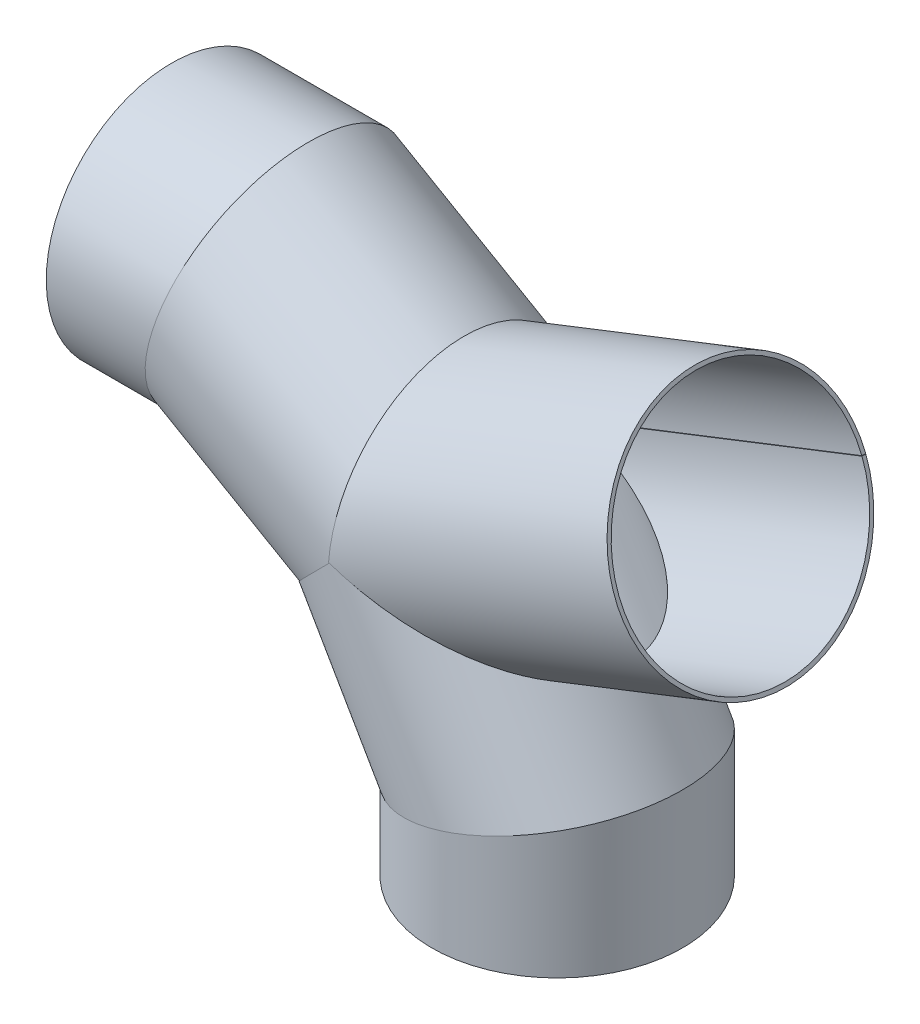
from build123d import *

# Parameters (mm, degrees)
SKETCH_2_R                 = 325
SKETCH_2_R_2               = 315
EXTRUDE_1_DEPTH            = 355.03268
EXTRUDE_2_DEPTH            = 355.03268
EXTRUDE_2_DEPTH_BACK       = 355.03268
SKETCH_3_R                 = 325
SKETCH_3_R_2               = 315
EXTRUDE_3_DEPTH            = 355.03268
EXTRUDE_3_DEPTH_BACK       = 355.03268
SKETCH_4_R                 = 325
SKETCH_4_R_2               = 315
SKETCH_5_R                 = 325
SKETCH_5_R_2               = 315
EXTRUDE_4_DEPTH            = 355.03268
SKETCH_6_R                 = 325
SKETCH_6_R_2               = 315
EXTRUDE_5_DEPTH            = 798.022966
CUT_EXTRUDE_3_DEPTH        = 1692.899584
CUT_EXTRUDE_3_DEPTH_BACK   = 1692.899584
CUT_EXTRUDE_4_DEPTH        = 1692.899584
CUT_EXTRUDE_4_DEPTH_BACK   = 1692.899584
CUT_EXTRUDE_5_DEPTH        = 1692.899584
CUT_EXTRUDE_5_DEPTH_BACK   = 1692.899584
CUT_EXTRUDE_6_DEPTH        = 1692.899584
CUT_EXTRUDE_6_DEPTH_BACK   = 1692.899584
CUT_EXTRUDE_1_DEPTH        = 1692.899584
CUT_EXTRUDE_1_DEPTH_BACK   = 1692.899584
SKETCH_13_OUTSIDE_W        = 2030.101
SKETCH_13_OUTSIDE_H        = 1761.949
CUT_EXTRUDE_2_DEPTH        = 1692.899584
CUT_EXTRUDE_2_DEPTH_BACK   = 1692.899584
CUT_EXTRUDE_7_DEPTH        = 1692.899584
CUT_EXTRUDE_7_DEPTH_BACK   = 1692.899584
CUT_EXTRUDE_8_DEPTH        = 1692.899584
CUT_EXTRUDE_8_DEPTH_BACK   = 1692.899584
SKETCH_7_W                 = 325
SKETCH_7_H                 = 1
CUT_EXTRUDE_2_2_DEPTH      = 1692.899584
CUT_EXTRUDE_3_2_DEPTH      = 1271.370545
CUT_EXTRUDE_3_2_DEPTH_BACK = 1271.370545
SKETCH_8_W                 = 325
SKETCH_8_H                 = 1
CUT_EXTRUDE_4_2_DEPTH      = 1646.44055
CUT_EXTRUDE_4_2_DEPTH_BACK = 1646.44055
SKETCH_9_W                 = 1
SKETCH_9_H                 = 325
SKETCH_10_W                = 1
SKETCH_10_H                = 325
CUT_EXTRUDE_6_2_DEPTH      = 2099.139948
CUT_EXTRUDE_7_2_DEPTH      = 1692.899584


with BuildPart() as part:
    # Sketch 2 → Extrude 1 (new body)
    with BuildSketch(Plane(origin=(0, 0, 0), x_dir=(1, 0, 0), z_dir=(0, 1, 0))):
        Circle(SKETCH_2_R)
        Circle(SKETCH_2_R_2, mode=Mode.SUBTRACT)
    extrude(amount=EXTRUDE_1_DEPTH)

    # Sketch 11 → Cut-Extrude 3 (cut, two sides: drawn at the far end of the back side and taken through both)
    with BuildSketch(Plane.XY.offset(-CUT_EXTRUDE_3_DEPTH_BACK)):
        Polygon((-5014.032307, -1075.556715), (-1000, 0), (325, 355.03268), (4339.032307, 1430.589395), (2187.918877, 9458.654009), (-7165.145737, 6952.507899), align=None)
    extrude(amount=CUT_EXTRUDE_3_DEPTH + CUT_EXTRUDE_3_DEPTH_BACK, mode=Mode.SUBTRACT)

    # Sketch 7 → Cut-Extrude 2 2 (cut, through all)
    with BuildSketch(Plane(origin=(0, 0, 0), x_dir=(1, 0, 0), z_dir=(0, 1, 0))):
        with Locations((-162.5, 0)):
            Rectangle(SKETCH_7_W, SKETCH_7_H)
    extrude(amount=CUT_EXTRUDE_2_2_DEPTH, mode=Mode.SUBTRACT)


with BuildPart() as body_2:
    # Sketch 3 → Extrude 2 (new, two sides: drawn at the far end of the back side and taken through both)
    with BuildSketch(Plane(origin=(-250, 433.012702, 0), x_dir=(0.8660254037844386, 0.5, 0), z_dir=(0.5000000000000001, -0.8660254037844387, 0)).offset(-EXTRUDE_2_DEPTH_BACK)):
        with Locations((133.974596, 0)):
            Circle(SKETCH_3_R)
        with Locations((133.974596, 0)):
            Circle(SKETCH_3_R_2, mode=Mode.SUBTRACT)
    extrude(amount=EXTRUDE_2_DEPTH + EXTRUDE_2_DEPTH_BACK)

    # Sketch 11_2 → Cut-Extrude 4 (cut, two sides: drawn at the far end of the back side and taken through both)
    with BuildSketch(Plane.XY.offset(-CUT_EXTRUDE_4_DEPTH_BACK)):
        Polygon((-5014.032307, -1075.556715), (-1000, 0), (325, 355.03268), (4339.032307, 1430.589395), (6490.145737, -6597.475219), (-2862.918877, -9103.621329), align=None)
    extrude(amount=CUT_EXTRUDE_4_DEPTH + CUT_EXTRUDE_4_DEPTH_BACK, mode=Mode.SUBTRACT)


with BuildPart() as body_3:
    # Sketch 4 → Extrude 3 (new, two sides: drawn at the far end of the back side and taken through both)
    with BuildSketch(Plane(origin=(-750, 433.012702, 0), x_dir=(0, 0, 1), z_dir=(-0.8660254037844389, 0.4999999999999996, 0)).offset(-EXTRUDE_3_DEPTH_BACK)):
        with Locations((0, 500)):
            Circle(SKETCH_4_R)
        with Locations((0, 500)):
            Circle(SKETCH_4_R_2, mode=Mode.SUBTRACT)
    extrude(amount=EXTRUDE_3_DEPTH + EXTRUDE_3_DEPTH_BACK)

    # Sketch 12_2 → Cut-Extrude 6 (cut, two sides: drawn at the far end of the back side and taken through both)
    with BuildSketch(Plane.XY.offset(-CUT_EXTRUDE_6_DEPTH_BACK)):
        Polygon((-2075.556715, -4014.032307), (-1000, 0), (-644.96732, 1325), (430.589395, 5339.032307), (-7597.475219, 7490.145737), (-10103.621329, -1862.918877), align=None)
    extrude(amount=CUT_EXTRUDE_6_DEPTH + CUT_EXTRUDE_6_DEPTH_BACK, mode=Mode.SUBTRACT)


with BuildPart() as body_4:
    # Sketch 5 → Extrude 4 (new body)
    with BuildSketch(Plane(origin=(-1000, 0, 0), x_dir=(0, 0, -1), z_dir=(1, 0, 0))):
        with Locations((0, 1000)):
            Circle(SKETCH_5_R)
        with Locations((0, 1000)):
            Circle(SKETCH_5_R_2, mode=Mode.SUBTRACT)
    extrude(amount=EXTRUDE_4_DEPTH)

    # Sketch 12 → Cut-Extrude 5 (cut, two sides: drawn at the far end of the back side and taken through both)
    with BuildSketch(Plane.XY.offset(-CUT_EXTRUDE_5_DEPTH_BACK)):
        Polygon((-2075.556715, -4014.032307), (-1000, 0), (-644.96732, 1325), (430.589395, 5339.032307), (8458.654009, 3187.918877), (5952.507899, -6165.145737), align=None)
    extrude(amount=CUT_EXTRUDE_5_DEPTH + CUT_EXTRUDE_5_DEPTH_BACK, mode=Mode.SUBTRACT)

    # Sketch 10 → Cut-Extrude 6 2 (cut, through all)
    with BuildSketch(Plane(origin=(-1000, 0, 0), x_dir=(0, 0, -1), z_dir=(1, 0, 0))):
        with Locations((0, 837.5)):
            Rectangle(SKETCH_10_W, SKETCH_10_H)
    extrude(amount=CUT_EXTRUDE_6_2_DEPTH, mode=Mode.SUBTRACT)


with BuildPart() as body_5:
    # Sketch 6 → Extrude 5 (new body)
    with BuildSketch(Plane(origin=(475.214645, 1022.822477, 0), x_dir=(-0.3643650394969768, 0.9312562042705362, 0), z_dir=(0.9312562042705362, 0.3643650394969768, 0))):
        Circle(SKETCH_6_R)
        Circle(SKETCH_6_R_2, mode=Mode.SUBTRACT)
    extrude(amount=-EXTRUDE_5_DEPTH)

    # Sketch 13 outside → Cut-Extrude 1 (cut, two sides: drawn at the far end of the back side and taken through both)
    with BuildSketch(Plane.XY.offset(-CUT_EXTRUDE_1_DEPTH_BACK)):
        with Locations((-203.1835, 662.7405)):
            Rectangle(SKETCH_13_OUTSIDE_W, SKETCH_13_OUTSIDE_H)
        Polygon((-240.81066, 1091.660044), (-267.949192, 732.050808), (202.537786, 567.143457), (593.633283, 720.164211), (356.796008, 1325.480743), align=None, mode=Mode.SUBTRACT)
    extrude(amount=CUT_EXTRUDE_1_DEPTH + CUT_EXTRUDE_1_DEPTH_BACK, mode=Mode.SUBTRACT)

    # Sketch 1 → Cut-Extrude 7 2 (cut, through all)
    with BuildSketch(Plane.XY):
        Polygon((-267.76701, 731.585179), (475.396828, 1022.356849), (475.032463, 1023.288105), (-268.131375, 732.516436), align=None)
    extrude(amount=-CUT_EXTRUDE_7_2_DEPTH, mode=Mode.SUBTRACT)


with BuildPart() as cut_extrude_2_tool:
    # Sketch 13_2 → Cut-Extrude 2 (new, two sides: drawn at the far end of the back side and taken through both)
    with BuildSketch(Plane.XY.offset(-CUT_EXTRUDE_2_DEPTH_BACK)):
        Polygon((-240.81066, 1091.660044), (-267.949192, 732.050808), (202.537786, 567.143457), (593.633283, 720.164211), (356.796008, 1325.480743), align=None)
    extrude(amount=CUT_EXTRUDE_2_DEPTH + CUT_EXTRUDE_2_DEPTH_BACK)


with BuildPart() as body_3_1:
    add(body_3.part)

    # Cut-Extrude 2: cut by cut_extrude_2_tool
    add(cut_extrude_2_tool.part, mode=Mode.SUBTRACT)

    # Sketch 14_2 → Cut-Extrude 8 (cut, two sides: drawn at the far end of the back side and taken through both)
    with BuildSketch(Plane.XY.offset(-CUT_EXTRUDE_8_DEPTH_BACK)):
        Polygon((-4876.917175, -3926.88674), (-1000, -10), (939.93464, 1949.93464), (4816.851815, 5866.82138), (12650.625295, -1887.01297), (2956.856305, -11680.72109), align=None)
    extrude(amount=CUT_EXTRUDE_8_DEPTH + CUT_EXTRUDE_8_DEPTH_BACK, mode=Mode.SUBTRACT)

    # Sketch 9 → Cut-Extrude 4 2 (cut, two sides: drawn at the far end of the back side and taken through both)
    with BuildSketch(Plane(origin=(-750, 433.012702, 0), x_dir=(0, 0, 1), z_dir=(-0.8660254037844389, 0.4999999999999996, 0)).offset(-CUT_EXTRUDE_4_2_DEPTH_BACK)):
        with Locations((0, 337.5)):
            Rectangle(SKETCH_9_W, SKETCH_9_H)
    extrude(amount=CUT_EXTRUDE_4_2_DEPTH + CUT_EXTRUDE_4_2_DEPTH_BACK, mode=Mode.SUBTRACT)


with BuildPart() as body_2_1:
    add(body_2.part)

    # Cut-Extrude 2: cut by cut_extrude_2_tool
    add(cut_extrude_2_tool.part, mode=Mode.SUBTRACT)

    # Sketch 14 → Cut-Extrude 7 (cut, two sides: drawn at the far end of the back side and taken through both)
    with BuildSketch(Plane.XY.offset(-CUT_EXTRUDE_7_DEPTH_BACK)):
        Polygon((-4876.917175, -3926.88674), (-1000, -10), (939.93464, 1949.93464), (4816.851815, 5866.82138), (-3016.921665, 13620.65573), (-12710.690655, 3826.94761), align=None)
    extrude(amount=CUT_EXTRUDE_7_DEPTH + CUT_EXTRUDE_7_DEPTH_BACK, mode=Mode.SUBTRACT)

    # Sketch 8 → Cut-Extrude 3 2 (cut, two sides: drawn at the far end of the back side and taken through both)
    with BuildSketch(Plane(origin=(-250, 433.012702, 0), x_dir=(0.8660254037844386, 0.5, 0), z_dir=(0.5000000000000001, -0.8660254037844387, 0)).offset(-CUT_EXTRUDE_3_2_DEPTH_BACK)):
        with Locations((-28.525404, 0)):
            Rectangle(SKETCH_8_W, SKETCH_8_H)
    extrude(amount=CUT_EXTRUDE_3_2_DEPTH + CUT_EXTRUDE_3_2_DEPTH_BACK, mode=Mode.SUBTRACT)


solid = Compound([part.part, body_4.part, body_5.part, body_3_1.part, body_2_1.part])
